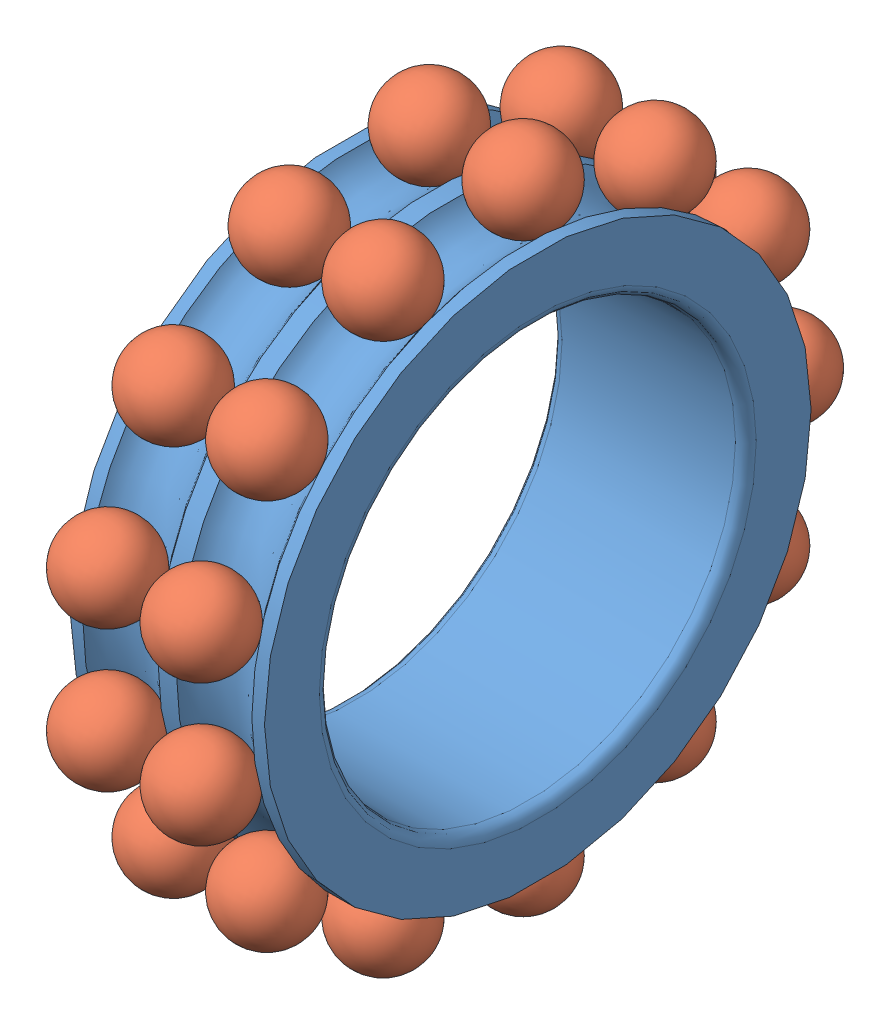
SolidWorks assembly Roulement_r2rb24.SLDASM, configuration Défaut (file format 5000). Lengths in mm.
Overall size (28 98.3 97.58).
27 component instances, 2 part files, 3 mates.
Components (placement in the parent):
- Roulement_r2rb_Bint24-1: Roulement_r2rb_Bint24.SLDPRT [Défaut] at origin size (28 78.8 78.8)
- Roulement_r2rb_Eroul24-1: Roulement_r2rb_Eroul24.SLDPRT [Défaut] at (7.25 0 -42.5) size (12.5 12.5 12.5)
- Roulement_r2rb_Eroul24-2: Roulement_r2rb_Eroul24.SLDPRT [Défaut] at (7.25 -19.7507 -37.6319) x (1 0 0) z (0 0.464723 0.885456) size (12.5 12.5 12.5)
- Roulement_r2rb_Eroul24-3: Roulement_r2rb_Eroul24.SLDPRT [Défaut] at (7.25 -34.9768 -24.1428) x (1 0 0) z (0 0.822984 0.568065) size (12.5 12.5 12.5)
- Roulement_r2rb_Eroul24-4: Roulement_r2rb_Eroul24.SLDPRT [Défaut] at (7.25 -42.1901 -5.1228) x (1 0 0) z (0 0.992709 0.120537) size (12.5 12.5 12.5)
- Roulement_r2rb_Eroul24-5: Roulement_r2rb_Eroul24.SLDPRT [Défaut] at (7.25 -39.7382 15.0707) x (1 0 0) z (0 0.935016 -0.354605) size (12.5 12.5 12.5)
- Roulement_r2rb_Eroul24-6: Roulement_r2rb_Eroul24.SLDPRT [Défaut] at (7.25 -28.1827 31.8117) x (1 0 0) z (0 0.663123 -0.748511) size (12.5 12.5 12.5)
- Roulement_r2rb_Eroul24-7: Roulement_r2rb_Eroul24.SLDPRT [Défaut] at (7.25 -10.1709 41.265) x (1 0 0) z (0 0.239316 -0.970942) size (12.5 12.5 12.5)
- Roulement_r2rb_Eroul24-8: Roulement_r2rb_Eroul24.SLDPRT [Défaut] at (7.25 10.1709 41.265) x (1 0 0) z (0 -0.239316 -0.970942) size (12.5 12.5 12.5)
- Roulement_r2rb_Eroul24-9: Roulement_r2rb_Eroul24.SLDPRT [Défaut] at (7.25 28.1827 31.8117) x (1 0 0) z (0 -0.663123 -0.748511) size (12.5 12.5 12.5)
- Roulement_r2rb_Eroul24-11: Roulement_r2rb_Eroul24.SLDPRT [Défaut] at (20.75 0 -42.5) size (12.5 12.5 12.5)
- Roulement_r2rb_Eroul24-10: Roulement_r2rb_Eroul24.SLDPRT [Défaut] at (7.25 39.7382 15.0707) x (1 0 0) z (0 -0.935016 -0.354605) size (12.5 12.5 12.5)
- Roulement_r2rb_Eroul24-12: Roulement_r2rb_Eroul24.SLDPRT [Défaut] at (20.75 -19.7507 -37.6319) x (1 0 0) z (0 0.464723 0.885456) size (12.5 12.5 12.5)
- Roulement_r2rb_Eroul24-13: Roulement_r2rb_Eroul24.SLDPRT [Défaut] at (20.75 -34.9768 -24.1428) x (1 0 0) z (0 0.822984 0.568065) size (12.5 12.5 12.5)
- Roulement_r2rb_Eroul24-14: Roulement_r2rb_Eroul24.SLDPRT [Défaut] at (20.75 -42.1901 -5.1228) x (1 0 0) z (0 0.992709 0.120537) size (12.5 12.5 12.5)
- Roulement_r2rb_Eroul24-15: Roulement_r2rb_Eroul24.SLDPRT [Défaut] at (20.75 -39.7382 15.0707) x (1 0 0) z (0 0.935016 -0.354605) size (12.5 12.5 12.5)
- Roulement_r2rb_Eroul24-16: Roulement_r2rb_Eroul24.SLDPRT [Défaut] at (20.75 -28.1827 31.8117) x (1 0 0) z (0 0.663123 -0.748511) size (12.5 12.5 12.5)
- Roulement_r2rb_Eroul24-17: Roulement_r2rb_Eroul24.SLDPRT [Défaut] at (20.75 -10.1709 41.265) x (1 0 0) z (0 0.239316 -0.970942) size (12.5 12.5 12.5)
- Roulement_r2rb_Eroul24-18: Roulement_r2rb_Eroul24.SLDPRT [Défaut] at (20.75 10.1709 41.265) x (1 0 0) z (0 -0.239316 -0.970942) size (12.5 12.5 12.5)
- Roulement_r2rb_Eroul24-19: Roulement_r2rb_Eroul24.SLDPRT [Défaut] at (20.75 28.1827 31.8117) x (1 0 0) z (0 -0.663123 -0.748511) size (12.5 12.5 12.5)
- Roulement_r2rb_Eroul24-20: Roulement_r2rb_Eroul24.SLDPRT [Défaut] at (20.75 39.7382 15.0707) x (1 0 0) z (0 -0.935016 -0.354605) size (12.5 12.5 12.5)
- Roulement_r2rb_Eroul24-21: Roulement_r2rb_Eroul24.SLDPRT [Défaut] at (20.75 42.1901 -5.1228) x (1 0 0) z (0 -0.992709 0.120537) size (12.5 12.5 12.5)
- Roulement_r2rb_Eroul24-22: Roulement_r2rb_Eroul24.SLDPRT [Défaut] at (20.75 34.9768 -24.1428) x (1 0 0) z (0 -0.822984 0.568065) size (12.5 12.5 12.5)
- Roulement_r2rb_Eroul24-23: Roulement_r2rb_Eroul24.SLDPRT [Défaut] at (20.75 19.7507 -37.6319) x (1 0 0) z (0 -0.464723 0.885456) size (12.5 12.5 12.5)
- Roulement_r2rb_Eroul24-24: Roulement_r2rb_Eroul24.SLDPRT [Défaut] at (7.25 42.1901 -5.1228) x (1 0 0) z (0 -0.992709 0.120537) size (12.5 12.5 12.5)
- Roulement_r2rb_Eroul24-25: Roulement_r2rb_Eroul24.SLDPRT [Défaut] at (7.25 34.9768 -24.1428) x (1 0 0) z (0 -0.822984 0.568065) size (12.5 12.5 12.5)
- Roulement_r2rb_Eroul24-26: Roulement_r2rb_Eroul24.SLDPRT [Défaut] at (7.25 19.7507 -37.6319) x (1 0 0) z (0 -0.464723 0.885456) size (12.5 12.5 12.5)
Mates (geometry in assembly coordinates):
- Coïncidente1: coincident: point of Roulement_r2rb_Bint24-1; point of assembly
- Coïncidente3: coincident: point of Roulement_r2rb_Eroul24-1; point of assembly
- Coïncidente5: coincident: point of Roulement_r2rb_Eroul24-11; point of assembly
